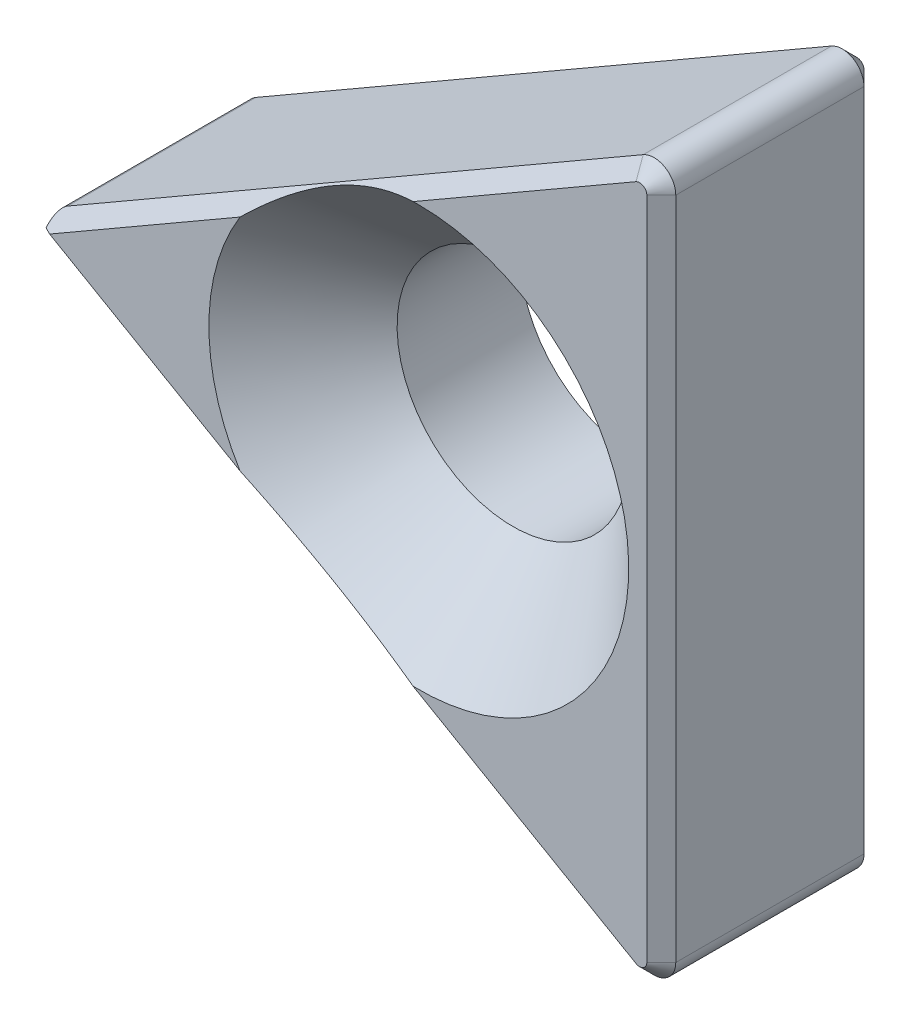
ISO-10303-21;
HEADER;
FILE_DESCRIPTION(('STEP AP214'),'2;1');
FILE_NAME('part.step','',(''),(''),'','','');
FILE_SCHEMA(('AUTOMOTIVE_DESIGN { 1 0 10303 214 1 1 1 1 }'));
ENDSEC;
DATA;
#1=APPLICATION_CONTEXT('core data for automotive mechanical design processes');
#2=APPLICATION_PROTOCOL_DEFINITION('international standard','automotive_design',2000,#1);
#3=PRODUCT_CONTEXT('',#1,'mechanical');
#4=PRODUCT('Part','Part','',(#3));
#5=PRODUCT_RELATED_PRODUCT_CATEGORY('part','',(#4));
#6=PRODUCT_DEFINITION_FORMATION('','',#4);
#7=PRODUCT_DEFINITION_CONTEXT('part definition',#1,'design');
#8=PRODUCT_DEFINITION('design','',#6,#7);
#9=PRODUCT_DEFINITION_SHAPE('','',#8);
#10=(LENGTH_UNIT() NAMED_UNIT(*) SI_UNIT(.MILLI.,.METRE.));
#11=(NAMED_UNIT(*) PLANE_ANGLE_UNIT() SI_UNIT($,.RADIAN.));
#12=(NAMED_UNIT(*) SI_UNIT($,.STERADIAN.) SOLID_ANGLE_UNIT());
#13=UNCERTAINTY_MEASURE_WITH_UNIT(LENGTH_MEASURE(1.E-05),#10,'distance_accuracy_value','');
#14=(GEOMETRIC_REPRESENTATION_CONTEXT(3) GLOBAL_UNCERTAINTY_ASSIGNED_CONTEXT((#13)) GLOBAL_UNIT_ASSIGNED_CONTEXT((#10,
#11,#12)) REPRESENTATION_CONTEXT('',''));
#15=CARTESIAN_POINT('',(0.,0.,0.));
#16=DIRECTION('',(0.,0.,1.));
#17=DIRECTION('',(1.,0.,0.));
#18=AXIS2_PLACEMENT_3D('',#15,#16,#17);
#19=CARTESIAN_POINT('',(3.05,-4.58993464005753,2.8000000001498));
#20=DIRECTION('',(0.,0.,-1.));
#21=DIRECTION('',(0.,-1.,0.));
#22=AXIS2_PLACEMENT_3D('',#19,#20,#21);
#23=CONICAL_SURFACE('',#22,0.299999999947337,0.785398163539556);
#24=DIRECTION('',(0.353553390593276,0.612372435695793,0.707106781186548));
#25=VECTOR('',#24,1.);
#26=CARTESIAN_POINT('',(2.9,-4.84974226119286,2.8));
#27=LINE('',#26,#25);
#28=CARTESIAN_POINT('',(2.9,-4.84974226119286,2.8));
#29=VERTEX_POINT('',#28);
#30=CARTESIAN_POINT('',(2.99999999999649,-4.6765371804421,2.99999999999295));
#31=VERTEX_POINT('',#30);
#32=EDGE_CURVE('E106',#29,#31,#27,.T.);
#33=ORIENTED_EDGE('',*,*,#32,.F.);
#34=CARTESIAN_POINT('',(3.05,-4.58993464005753,2.8));
#35=DIRECTION('',(0.,0.,-1.));
#36=DIRECTION('',(0.,-1.,0.));
#37=AXIS2_PLACEMENT_3D('',#34,#35,#36);
#38=CIRCLE('',#37,0.3);
#39=CARTESIAN_POINT('',(3.35,-4.58993464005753,2.8));
#40=VERTEX_POINT('',#39);
#41=EDGE_CURVE('E301',#40,#29,#38,.T.);
#42=ORIENTED_EDGE('',*,*,#41,.F.);
#43=DIRECTION('',(0.707106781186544,0.,-0.707106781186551));
#44=VECTOR('',#43,1.);
#45=CARTESIAN_POINT('',(3.15,-4.58993464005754,3.));
#46=LINE('',#45,#44);
#47=CARTESIAN_POINT('',(3.15000000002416,-4.58993464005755,2.99999999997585));
#48=VERTEX_POINT('',#47);
#49=EDGE_CURVE('E291',#48,#40,#46,.T.);
#50=ORIENTED_EDGE('',*,*,#49,.F.);
#51=CARTESIAN_POINT('',(3.05,-4.58993464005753,2.9999999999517));
#52=DIRECTION('',(0.,0.,-1.));
#53=DIRECTION('',(0.,-1.,0.));
#54=AXIS2_PLACEMENT_3D('',#51,#52,#53);
#55=CIRCLE('',#54,0.100000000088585);
#56=EDGE_CURVE('E17',#31,#48,#55,.F.);
#57=ORIENTED_EDGE('',*,*,#56,.F.);
#58=EDGE_LOOP('',(#33,#42,#50,#57));
#59=FACE_BOUND('',#58,.T.);
#60=ADVANCED_FACE('F14',(#59),#23,.T.);
#61=CARTESIAN_POINT('',(3.05,4.58993464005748,2.79999999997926));
#62=DIRECTION('',(0.,0.,-1.));
#63=DIRECTION('',(0.,-1.,0.));
#64=AXIS2_PLACEMENT_3D('',#61,#62,#63);
#65=CONICAL_SURFACE('',#64,0.300000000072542,0.785398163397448);
#66=DIRECTION('',(0.707106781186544,0.,-0.707106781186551));
#67=VECTOR('',#66,1.);
#68=CARTESIAN_POINT('',(3.15,4.58993464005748,3.));
#69=LINE('',#68,#67);
#70=CARTESIAN_POINT('',(3.35,4.58993464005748,2.8));
#71=VERTEX_POINT('',#70);
#72=CARTESIAN_POINT('',(3.15000000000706,4.58993464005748,2.99999999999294));
#73=VERTEX_POINT('',#72);
#74=EDGE_CURVE('E294',#71,#73,#69,.F.);
#75=ORIENTED_EDGE('',*,*,#74,.F.);
#76=CARTESIAN_POINT('',(3.05,4.58993464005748,2.8));
#77=DIRECTION('',(0.,0.,-1.));
#78=DIRECTION('',(0.,-1.,0.));
#79=AXIS2_PLACEMENT_3D('',#76,#77,#78);
#80=CIRCLE('',#79,0.3);
#81=CARTESIAN_POINT('',(2.9,4.84974226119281,2.8));
#82=VERTEX_POINT('',#81);
#83=EDGE_CURVE('E288',#82,#71,#80,.T.);
#84=ORIENTED_EDGE('',*,*,#83,.F.);
#85=DIRECTION('',(-0.353553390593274,0.612372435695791,-0.707106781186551));
#86=VECTOR('',#85,1.);
#87=CARTESIAN_POINT('',(3.,4.67653718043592,3.));
#88=LINE('',#87,#86);
#89=CARTESIAN_POINT('',(2.99999999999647,4.67653718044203,2.99999999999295));
#90=VERTEX_POINT('',#89);
#91=EDGE_CURVE('E267',#90,#82,#88,.T.);
#92=ORIENTED_EDGE('',*,*,#91,.F.);
#93=CARTESIAN_POINT('',(3.05,4.58993464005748,2.99999999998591));
#94=DIRECTION('',(0.,0.,-1.));
#95=DIRECTION('',(0.,-1.,0.));
#96=AXIS2_PLACEMENT_3D('',#93,#94,#95);
#97=CIRCLE('',#96,0.100000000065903);
#98=EDGE_CURVE('E279',#73,#90,#97,.F.);
#99=ORIENTED_EDGE('',*,*,#98,.F.);
#100=EDGE_LOOP('',(#75,#84,#92,#99));
#101=FACE_BOUND('',#100,.T.);
#102=ADVANCED_FACE('F149',(#101),#65,.T.);
#103=CARTESIAN_POINT('',(3.05,-4.58993464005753,3.));
#104=DIRECTION('',(0.,0.,-1.));
#105=DIRECTION('',(0.,-1.,0.));
#106=AXIS2_PLACEMENT_3D('',#103,#104,#105);
#107=CYLINDRICAL_SURFACE('',#106,0.3);
#108=CARTESIAN_POINT('',(3.05,-4.58993464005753,0.2));
#109=DIRECTION('',(0.,0.,-1.));
#110=DIRECTION('',(0.,-1.,0.));
#111=AXIS2_PLACEMENT_3D('',#108,#109,#110);
#112=CIRCLE('',#111,0.3);
#113=CARTESIAN_POINT('',(2.8999999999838,-4.84974226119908,0.20000000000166));
#114=VERTEX_POINT('',#113);
#115=CARTESIAN_POINT('',(3.35,-4.58993464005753,0.2));
#116=VERTEX_POINT('',#115);
#117=EDGE_CURVE('E296',#114,#116,#112,.F.);
#118=ORIENTED_EDGE('',*,*,#117,.T.);
#119=DIRECTION('',(0.,0.,1.));
#120=VECTOR('',#119,1.);
#121=CARTESIAN_POINT('',(3.35,-4.58993464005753,3.));
#122=LINE('',#121,#120);
#123=EDGE_CURVE('E252',#116,#40,#122,.T.);
#124=ORIENTED_EDGE('',*,*,#123,.T.);
#125=ORIENTED_EDGE('',*,*,#41,.T.);
#126=DIRECTION('',(0.,0.,1.));
#127=VECTOR('',#126,1.);
#128=CARTESIAN_POINT('',(2.9,-4.84974226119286,3.));
#129=LINE('',#128,#127);
#130=EDGE_CURVE('E256',#29,#114,#129,.F.);
#131=ORIENTED_EDGE('',*,*,#130,.T.);
#132=EDGE_LOOP('',(#118,#124,#125,#131));
#133=FACE_BOUND('',#132,.T.);
#134=ADVANCED_FACE('F146',(#133),#107,.T.);
#135=CARTESIAN_POINT('',(3.15,0.,3.));
#136=DIRECTION('',(0.707106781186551,0.,0.707106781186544));
#137=DIRECTION('',(0.707106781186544,0.,-0.707106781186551));
#138=AXIS2_PLACEMENT_3D('',#135,#136,#137);
#139=PLANE('',#138);
#140=ORIENTED_EDGE('',*,*,#49,.T.);
#141=DIRECTION('',(0.,-1.,0.));
#142=VECTOR('',#141,1.);
#143=CARTESIAN_POINT('',(3.35,-5.10954988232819,2.8));
#144=LINE('',#143,#142);
#145=EDGE_CURVE('E255',#40,#71,#144,.F.);
#146=ORIENTED_EDGE('',*,*,#145,.T.);
#147=ORIENTED_EDGE('',*,*,#74,.T.);
#148=DIRECTION('',(0.,1.,0.));
#149=VECTOR('',#148,1.);
#150=CARTESIAN_POINT('',(3.15,0.,3.));
#151=LINE('',#150,#149);
#152=EDGE_CURVE('E276',#48,#73,#151,.T.);
#153=ORIENTED_EDGE('',*,*,#152,.F.);
#154=EDGE_LOOP('',(#140,#146,#147,#153));
#155=FACE_BOUND('',#154,.T.);
#156=ADVANCED_FACE('F142',(#155),#139,.T.);
#157=CARTESIAN_POINT('',(3.05,4.58993464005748,3.));
#158=DIRECTION('',(0.,0.,-1.));
#159=DIRECTION('',(0.,-1.,0.));
#160=AXIS2_PLACEMENT_3D('',#157,#158,#159);
#161=CYLINDRICAL_SURFACE('',#160,0.3);
#162=DIRECTION('',(0.,0.,1.));
#163=VECTOR('',#162,1.);
#164=CARTESIAN_POINT('',(3.35,4.58993464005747,3.));
#165=LINE('',#164,#163);
#166=CARTESIAN_POINT('',(3.34999999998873,4.58993464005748,0.200000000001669));
#167=VERTEX_POINT('',#166);
#168=EDGE_CURVE('E249',#71,#167,#165,.F.);
#169=ORIENTED_EDGE('',*,*,#168,.T.);
#170=CARTESIAN_POINT('',(3.05,4.58993464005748,0.2));
#171=DIRECTION('',(0.,0.,-1.));
#172=DIRECTION('',(0.,-1.,0.));
#173=AXIS2_PLACEMENT_3D('',#170,#171,#172);
#174=CIRCLE('',#173,0.3);
#175=CARTESIAN_POINT('',(2.9,4.84974226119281,0.2));
#176=VERTEX_POINT('',#175);
#177=EDGE_CURVE('E283',#167,#176,#174,.F.);
#178=ORIENTED_EDGE('',*,*,#177,.T.);
#179=DIRECTION('',(0.,0.,1.));
#180=VECTOR('',#179,1.);
#181=CARTESIAN_POINT('',(2.9,4.84974226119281,3.));
#182=LINE('',#181,#180);
#183=EDGE_CURVE('E246',#176,#82,#182,.T.);
#184=ORIENTED_EDGE('',*,*,#183,.T.);
#185=ORIENTED_EDGE('',*,*,#83,.T.);
#186=EDGE_LOOP('',(#169,#178,#184,#185));
#187=FACE_BOUND('',#186,.T.);
#188=ADVANCED_FACE('F138',(#187),#161,.T.);
#189=CARTESIAN_POINT('',(-4.9,0.,3.));
#190=DIRECTION('',(0.,0.,-1.));
#191=DIRECTION('',(0.,-1.,0.));
#192=AXIS2_PLACEMENT_3D('',#189,#190,#191);
#193=CYLINDRICAL_SURFACE('',#192,0.3);
#194=DIRECTION('',(0.,0.,1.));
#195=VECTOR('',#194,1.);
#196=CARTESIAN_POINT('',(-5.05,0.259807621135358,3.));
#197=LINE('',#196,#195);
#198=CARTESIAN_POINT('',(-5.05,0.259807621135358,2.8));
#199=VERTEX_POINT('',#198);
#200=CARTESIAN_POINT('',(-5.05,0.259807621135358,0.2));
#201=VERTEX_POINT('',#200);
#202=EDGE_CURVE('E97',#199,#201,#197,.F.);
#203=ORIENTED_EDGE('',*,*,#202,.T.);
#204=CARTESIAN_POINT('',(-4.9,0.,0.2));
#205=DIRECTION('',(0.,0.,-1.));
#206=DIRECTION('',(0.,-1.,0.));
#207=AXIS2_PLACEMENT_3D('',#204,#205,#206);
#208=CIRCLE('',#207,0.3);
#209=CARTESIAN_POINT('',(-5.05,-0.259807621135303,0.2));
#210=VERTEX_POINT('',#209);
#211=EDGE_CURVE('E210',#201,#210,#208,.F.);
#212=ORIENTED_EDGE('',*,*,#211,.T.);
#213=DIRECTION('',(0.,0.,1.));
#214=VECTOR('',#213,1.);
#215=CARTESIAN_POINT('',(-5.05,-0.259807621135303,3.));
#216=LINE('',#215,#214);
#217=CARTESIAN_POINT('',(-5.05,-0.259807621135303,2.8));
#218=VERTEX_POINT('',#217);
#219=EDGE_CURVE('E264',#210,#218,#216,.T.);
#220=ORIENTED_EDGE('',*,*,#219,.T.);
#221=CARTESIAN_POINT('',(-4.9,0.,3.1));
#222=DIRECTION('',(-0.353553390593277,-0.612372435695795,0.707106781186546));
#223=DIRECTION('',(-0.353553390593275,-0.612372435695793,-0.707106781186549));
#224=AXIS2_PLACEMENT_3D('',#221,#222,#223);
#225=ELLIPSE('',#224,0.424264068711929,0.3);
#226=CARTESIAN_POINT('',(-5.2,0.,2.95));
#227=VERTEX_POINT('',#226);
#228=EDGE_CURVE('E305',#227,#218,#225,.T.);
#229=ORIENTED_EDGE('',*,*,#228,.F.);
#230=CARTESIAN_POINT('',(-4.9,0.,3.1));
#231=DIRECTION('',(-0.353553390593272,0.612372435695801,0.707106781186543));
#232=DIRECTION('',(-0.353553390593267,0.612372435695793,-0.707106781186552));
#233=AXIS2_PLACEMENT_3D('',#230,#231,#232);
#234=ELLIPSE('',#233,0.424264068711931,0.3);
#235=EDGE_CURVE('E274',#199,#227,#234,.T.);
#236=ORIENTED_EDGE('',*,*,#235,.F.);
#237=EDGE_LOOP('',(#203,#212,#220,#229,#236));
#238=FACE_BOUND('',#237,.T.);
#239=ADVANCED_FACE('F135',(#238),#193,.T.);
#240=CARTESIAN_POINT('',(-5.5,0.,3.));
#241=DIRECTION('',(0.,0.,1.));
#242=DIRECTION('',(0.,1.,0.));
#243=AXIS2_PLACEMENT_3D('',#240,#241,#242);
#244=PLANE('',#243);
#245=ORIENTED_EDGE('',*,*,#98,.T.);
#246=DIRECTION('',(0.866025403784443,0.499999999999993,0.));
#247=VECTOR('',#246,1.);
#248=CARTESIAN_POINT('',(-0.0789126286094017,2.89892614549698,3.));
#249=LINE('',#248,#247);
#250=CARTESIAN_POINT('',(-0.0789126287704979,2.89892614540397,3.));
#251=VERTEX_POINT('',#250);
#252=EDGE_CURVE('E91',#251,#90,#249,.T.);
#253=ORIENTED_EDGE('',*,*,#252,.F.);
#254=CARTESIAN_POINT('',(0.,0.,3.00000000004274));
#255=DIRECTION('',(0.,0.,1.));
#256=DIRECTION('',(0.,1.,0.));
#257=AXIS2_PLACEMENT_3D('',#254,#255,#256);
#258=CIRCLE('',#257,2.89999999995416);
#259=CARTESIAN_POINT('',(-0.0789126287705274,-2.89892614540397,3.));
#260=VERTEX_POINT('',#259);
#261=EDGE_CURVE('E86',#251,#260,#258,.F.);
#262=ORIENTED_EDGE('',*,*,#261,.T.);
#263=DIRECTION('',(-0.866025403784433,0.5,0.));
#264=VECTOR('',#263,1.);
#265=CARTESIAN_POINT('',(3.,-4.67653718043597,3.));
#266=LINE('',#265,#264);
#267=EDGE_CURVE('E89',#31,#260,#266,.T.);
#268=ORIENTED_EDGE('',*,*,#267,.F.);
#269=ORIENTED_EDGE('',*,*,#56,.T.);
#270=ORIENTED_EDGE('',*,*,#152,.T.);
#271=EDGE_LOOP('',(#245,#253,#262,#268,#269,#270));
#272=FACE_BOUND('',#271,.T.);
#273=ADVANCED_FACE('F88',(#272),#244,.T.);
#274=CARTESIAN_POINT('',(-5.4,0.173205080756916,3.));
#275=DIRECTION('',(-0.353553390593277,-0.612372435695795,0.707106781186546));
#276=DIRECTION('',(0.,0.755928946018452,0.654653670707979));
#277=AXIS2_PLACEMENT_3D('',#274,#275,#276);
#278=PLANE('',#277);
#279=DIRECTION('',(0.866025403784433,-0.5,0.));
#280=VECTOR('',#279,1.);
#281=CARTESIAN_POINT('',(-5.1,0.,3.));
#282=LINE('',#281,#280);
#283=CARTESIAN_POINT('',(-5.1,0.,3.));
#284=VERTEX_POINT('',#283);
#285=CARTESIAN_POINT('',(-2.47108737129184,-1.51780341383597,3.00000000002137));
#286=VERTEX_POINT('',#285);
#287=EDGE_CURVE('E107',#284,#286,#282,.T.);
#288=ORIENTED_EDGE('',*,*,#287,.F.);
#289=DIRECTION('',(0.894427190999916,0.,0.447213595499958));
#290=VECTOR('',#289,1.);
#291=CARTESIAN_POINT('',(-5.2,0.,2.95));
#292=LINE('',#291,#290);
#293=EDGE_CURVE('E271',#227,#284,#292,.T.);
#294=ORIENTED_EDGE('',*,*,#293,.F.);
#295=ORIENTED_EDGE('',*,*,#228,.T.);
#296=DIRECTION('',(-0.866025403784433,0.5,0.));
#297=VECTOR('',#296,1.);
#298=CARTESIAN_POINT('',(-5.5,0.,2.8));
#299=LINE('',#298,#297);
#300=EDGE_CURVE('E263',#218,#29,#299,.F.);
#301=ORIENTED_EDGE('',*,*,#300,.T.);
#302=ORIENTED_EDGE('',*,*,#32,.T.);
#303=ORIENTED_EDGE('',*,*,#267,.T.);
#304=CARTESIAN_POINT('',(-0.0789126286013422,-2.89892614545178,3.0000000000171));
#305=CARTESIAN_POINT('',(-0.192122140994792,-2.86696599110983,2.9710735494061));
#306=CARTESIAN_POINT('',(-0.305193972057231,-2.83137857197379,2.94535724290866));
#307=CARTESIAN_POINT('',(-0.530230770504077,-2.752758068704,2.90092619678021));
#308=CARTESIAN_POINT('',(-0.642194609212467,-2.70971808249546,2.88221799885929));
#309=CARTESIAN_POINT('',(-0.860537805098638,-2.61750952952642,2.85290135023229));
#310=CARTESIAN_POINT('',(-0.966982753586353,-2.56857185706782,2.84206014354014));
#311=CARTESIAN_POINT('',(-1.17685413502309,-2.46375999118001,2.827894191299));
#312=CARTESIAN_POINT('',(-1.28028213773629,-2.40788948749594,2.82456546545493));
#313=CARTESIAN_POINT('',(-1.48016581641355,-2.29139481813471,2.82551096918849));
#314=CARTESIAN_POINT('',(-1.57673799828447,-2.23096841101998,2.82955568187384));
#315=CARTESIAN_POINT('',(-1.76559564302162,-2.10447058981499,2.84467718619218));
#316=CARTESIAN_POINT('',(-1.85787910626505,-2.03839658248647,2.8557572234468));
#317=CARTESIAN_POINT('',(-2.04036040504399,-1.89918722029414,2.88507541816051));
#318=CARTESIAN_POINT('',(-2.1304051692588,-1.8258965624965,2.90352460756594));
#319=CARTESIAN_POINT('',(-2.30495118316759,-1.67494016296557,2.94698367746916));
#320=CARTESIAN_POINT('',(-2.38945716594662,-1.59727826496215,2.97198786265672));
#321=CARTESIAN_POINT('',(-2.4710873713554,-1.51780341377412,3.00000000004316));
#322=B_SPLINE_CURVE_WITH_KNOTS('',3,(#304,#305,#306,#307,#308,#309,#310,#311,#312,#313,#314,
#315,#316,#317,#318,#319,#320,#321),.UNSPECIFIED.,.F.,.F.,(4,2,2,2,2,2,2,2,4),(0.,
0.363414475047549,0.727167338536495,1.079662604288,1.43197106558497,1.77349968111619,
2.11518596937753,2.46745281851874,2.81941460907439),.UNSPECIFIED.);
#323=EDGE_CURVE('E96',#260,#286,#322,.T.);
#324=ORIENTED_EDGE('',*,*,#323,.T.);
#325=EDGE_LOOP('',(#288,#294,#295,#301,#302,#303,#324));
#326=FACE_BOUND('',#325,.T.);
#327=ADVANCED_FACE('F103',(#326),#278,.T.);
#328=CARTESIAN_POINT('',(-5.5,0.,3.));
#329=DIRECTION('',(0.,0.,1.));
#330=DIRECTION('',(0.,1.,0.));
#331=AXIS2_PLACEMENT_3D('',#328,#329,#330);
#332=PLANE('',#331);
#333=ORIENTED_EDGE('',*,*,#287,.T.);
#334=CARTESIAN_POINT('',(0.,0.,3.00000000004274));
#335=DIRECTION('',(0.,0.,1.));
#336=DIRECTION('',(0.,1.,0.));
#337=AXIS2_PLACEMENT_3D('',#334,#335,#336);
#338=CIRCLE('',#337,2.89999999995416);
#339=CARTESIAN_POINT('',(-2.4710873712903,1.51780341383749,3.00000000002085));
#340=VERTEX_POINT('',#339);
#341=EDGE_CURVE('E112',#286,#340,#338,.F.);
#342=ORIENTED_EDGE('',*,*,#341,.T.);
#343=DIRECTION('',(0.866025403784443,0.499999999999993,0.));
#344=VECTOR('',#343,1.);
#345=CARTESIAN_POINT('',(-5.1,0.,3.));
#346=LINE('',#345,#344);
#347=EDGE_CURVE('E269',#284,#340,#346,.T.);
#348=ORIENTED_EDGE('',*,*,#347,.F.);
#349=EDGE_LOOP('',(#333,#342,#348));
#350=FACE_BOUND('',#349,.T.);
#351=ADVANCED_FACE('F131',(#350),#332,.T.);
#352=CARTESIAN_POINT('',(-5.4,-0.173205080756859,3.));
#353=DIRECTION('',(-0.353553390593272,0.612372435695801,0.707106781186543));
#354=DIRECTION('',(0.,0.75592894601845,-0.654653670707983));
#355=AXIS2_PLACEMENT_3D('',#352,#353,#354);
#356=PLANE('',#355);
#357=ORIENTED_EDGE('',*,*,#252,.T.);
#358=ORIENTED_EDGE('',*,*,#91,.T.);
#359=DIRECTION('',(0.866025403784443,0.499999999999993,0.));
#360=VECTOR('',#359,1.);
#361=CARTESIAN_POINT('',(3.35,5.10954988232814,2.8));
#362=LINE('',#361,#360);
#363=EDGE_CURVE('E245',#82,#199,#362,.F.);
#364=ORIENTED_EDGE('',*,*,#363,.T.);
#365=ORIENTED_EDGE('',*,*,#235,.T.);
#366=ORIENTED_EDGE('',*,*,#293,.T.);
#367=ORIENTED_EDGE('',*,*,#347,.T.);
#368=CARTESIAN_POINT('',(-2.47108737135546,1.51780341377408,3.0000000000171));
#369=CARTESIAN_POINT('',(-2.38680430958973,1.59986565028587,2.9710735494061));
#370=CARTESIAN_POINT('',(-2.29944878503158,1.67999501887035,2.94535724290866));
#371=CARTESIAN_POINT('',(-2.1188430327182,1.83557235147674,2.90092619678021));
#372=CARTESIAN_POINT('',(-2.02558739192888,1.91101588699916,2.88221799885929));
#373=CARTESIAN_POINT('',(-1.8365608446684,2.05400236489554,2.85290135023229));
#374=CARTESIAN_POINT('',(-1.74095710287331,2.12171755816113,2.84206014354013));
#375=CARTESIAN_POINT('',(-1.54525167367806,2.25106557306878,2.827894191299));
#376=CARTESIAN_POINT('',(-1.44515239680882,2.31270159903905,2.82456546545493));
#377=CARTESIAN_POINT('',(-1.24432321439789,2.42755860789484,2.8255109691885));
#378=CARTESIAN_POINT('',(-1.14370631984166,2.48097936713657,2.82955568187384));
#379=CARTESIAN_POINT('',(-0.939727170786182,2.58128597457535,2.84467718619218));
#380=CARTESIAN_POINT('',(-0.836363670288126,2.6281687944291,2.8557572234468));
#381=CARTESIAN_POINT('',(-0.624564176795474,2.71659755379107,2.88507541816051));
#382=CARTESIAN_POINT('',(-0.516070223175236,2.75793327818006,2.90352460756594));
#383=CARTESIAN_POINT('',(-0.298065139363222,2.83361636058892,2.94698367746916));
#384=CARTESIAN_POINT('',(-0.188554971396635,2.86796973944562,2.97198786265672));
#385=CARTESIAN_POINT('',(-0.0789126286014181,2.89892614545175,3.00000000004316));
#386=B_SPLINE_CURVE_WITH_KNOTS('',3,(#368,#369,#370,#371,#372,#373,#374,#375,#376,#377,#378,
#379,#380,#381,#382,#383,#384,#385),.UNSPECIFIED.,.F.,.F.,(4,2,2,2,2,2,2,2,4),(0.,
0.363414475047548,0.727167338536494,1.079662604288,1.43197106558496,1.77349968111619,
2.11518596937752,2.46745281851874,2.81941460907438),.UNSPECIFIED.);
#387=EDGE_CURVE('E114',#340,#251,#386,.T.);
#388=ORIENTED_EDGE('',*,*,#387,.T.);
#389=EDGE_LOOP('',(#357,#358,#364,#365,#366,#367,#388));
#390=FACE_BOUND('',#389,.T.);
#391=ADVANCED_FACE('F313',(#390),#356,.T.);
#392=CARTESIAN_POINT('',(-5.5,0.,3.));
#393=DIRECTION('',(0.5,0.866025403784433,0.));
#394=DIRECTION('',(-0.866025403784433,0.5,0.));
#395=AXIS2_PLACEMENT_3D('',#392,#393,#394);
#396=PLANE('',#395);
#397=ORIENTED_EDGE('',*,*,#300,.F.);
#398=ORIENTED_EDGE('',*,*,#219,.F.);
#399=DIRECTION('',(0.866025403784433,-0.5,0.));
#400=VECTOR('',#399,1.);
#401=CARTESIAN_POINT('',(-5.05,-0.259807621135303,0.2));
#402=LINE('',#401,#400);
#403=EDGE_CURVE('E238',#210,#114,#402,.T.);
#404=ORIENTED_EDGE('',*,*,#403,.T.);
#405=ORIENTED_EDGE('',*,*,#130,.F.);
#406=EDGE_LOOP('',(#397,#398,#404,#405));
#407=FACE_BOUND('',#406,.T.);
#408=ADVANCED_FACE('F317',(#407),#396,.F.);
#409=CARTESIAN_POINT('',(3.35,-5.10954988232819,3.));
#410=DIRECTION('',(-1.,0.,0.));
#411=DIRECTION('',(0.,-1.,0.));
#412=AXIS2_PLACEMENT_3D('',#409,#410,#411);
#413=PLANE('',#412);
#414=ORIENTED_EDGE('',*,*,#145,.F.);
#415=ORIENTED_EDGE('',*,*,#123,.F.);
#416=DIRECTION('',(0.,1.,0.));
#417=VECTOR('',#416,1.);
#418=CARTESIAN_POINT('',(3.35,-5.10954988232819,0.2));
#419=LINE('',#418,#417);
#420=EDGE_CURVE('E235',#116,#167,#419,.T.);
#421=ORIENTED_EDGE('',*,*,#420,.T.);
#422=ORIENTED_EDGE('',*,*,#168,.F.);
#423=EDGE_LOOP('',(#414,#415,#421,#422));
#424=FACE_BOUND('',#423,.T.);
#425=ADVANCED_FACE('F321',(#424),#413,.F.);
#426=CARTESIAN_POINT('',(3.35,5.10954988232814,3.));
#427=DIRECTION('',(0.499999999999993,-0.866025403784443,0.));
#428=DIRECTION('',(0.866025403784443,0.499999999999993,0.));
#429=AXIS2_PLACEMENT_3D('',#426,#427,#428);
#430=PLANE('',#429);
#431=ORIENTED_EDGE('',*,*,#363,.F.);
#432=ORIENTED_EDGE('',*,*,#183,.F.);
#433=DIRECTION('',(-0.866025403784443,-0.499999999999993,0.));
#434=VECTOR('',#433,1.);
#435=CARTESIAN_POINT('',(2.9,4.84974226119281,0.2));
#436=LINE('',#435,#434);
#437=EDGE_CURVE('E215',#176,#201,#436,.T.);
#438=ORIENTED_EDGE('',*,*,#437,.T.);
#439=ORIENTED_EDGE('',*,*,#202,.F.);
#440=EDGE_LOOP('',(#431,#432,#438,#439));
#441=FACE_BOUND('',#440,.T.);
#442=ADVANCED_FACE('F199',(#441),#430,.F.);
#443=CARTESIAN_POINT('',(0.,0.,2.99999999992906));
#444=DIRECTION('',(0.,0.,1.));
#445=DIRECTION('',(0.,1.,0.));
#446=AXIS2_PLACEMENT_3D('',#443,#444,#445);
#447=CONICAL_SURFACE('',#446,2.89999999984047,0.785398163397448);
#448=CARTESIAN_POINT('',(0.,0.,1.7));
#449=DIRECTION('',(0.,0.,1.));
#450=DIRECTION('',(0.,1.,0.));
#451=AXIS2_PLACEMENT_3D('',#448,#449,#450);
#452=CIRCLE('',#451,1.6);
#453=CARTESIAN_POINT('',(0.,1.6,1.7));
#454=VERTEX_POINT('',#453);
#455=EDGE_CURVE('E214',#454,#454,#452,.F.);
#456=ORIENTED_EDGE('',*,*,#455,.T.);
#457=EDGE_LOOP('',(#456));
#458=FACE_BOUND('',#457,.T.);
#459=ORIENTED_EDGE('',*,*,#261,.F.);
#460=ORIENTED_EDGE('',*,*,#387,.F.);
#461=ORIENTED_EDGE('',*,*,#341,.F.);
#462=ORIENTED_EDGE('',*,*,#323,.F.);
#463=EDGE_LOOP('',(#459,#460,#461,#462));
#464=FACE_BOUND('',#463,.T.);
#465=ADVANCED_FACE('F110',(#458,#464),#447,.F.);
#466=CARTESIAN_POINT('',(-4.9,0.,0.199999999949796));
#467=DIRECTION('',(0.,0.,1.));
#468=DIRECTION('',(1.,0.,0.));
#469=AXIS2_PLACEMENT_3D('',#466,#467,#468);
#470=CONICAL_SURFACE('',#469,0.299999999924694,0.785398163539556);
#471=DIRECTION('',(0.353553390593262,-0.6123724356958,-0.707106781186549));
#472=VECTOR('',#471,1.);
#473=CARTESIAN_POINT('',(-5.05,0.259807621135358,0.2));
#474=LINE('',#473,#472);
#475=CARTESIAN_POINT('',(-4.95000000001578,0.0866025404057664,3.1518089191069E-11));
#476=VERTEX_POINT('',#475);
#477=EDGE_CURVE('E205',#201,#476,#474,.T.);
#478=ORIENTED_EDGE('',*,*,#477,.T.);
#479=CARTESIAN_POINT('',(-4.9,0.,6.30361648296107E-11));
#480=DIRECTION('',(0.,0.,1.));
#481=DIRECTION('',(1.,0.,0.));
#482=AXIS2_PLACEMENT_3D('',#479,#480,#481);
#483=CIRCLE('',#482,0.099999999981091);
#484=CARTESIAN_POINT('',(-4.95000000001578,-0.0866025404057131,3.15180526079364E-11));
#485=VERTEX_POINT('',#484);
#486=EDGE_CURVE('E208',#476,#485,#483,.T.);
#487=ORIENTED_EDGE('',*,*,#486,.T.);
#488=DIRECTION('',(-0.353553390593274,-0.612372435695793,0.707106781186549));
#489=VECTOR('',#488,1.);
#490=CARTESIAN_POINT('',(-4.95,-0.0866025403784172,0.));
#491=LINE('',#490,#489);
#492=EDGE_CURVE('E239',#485,#210,#491,.T.);
#493=ORIENTED_EDGE('',*,*,#492,.T.);
#494=ORIENTED_EDGE('',*,*,#211,.F.);
#495=EDGE_LOOP('',(#478,#487,#493,#494));
#496=FACE_BOUND('',#495,.T.);
#497=ADVANCED_FACE('F191',(#496),#470,.T.);
#498=CARTESIAN_POINT('',(-5.5,0.,0.2));
#499=DIRECTION('',(0.353553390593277,0.612372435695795,0.707106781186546));
#500=DIRECTION('',(0.,0.755928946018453,-0.654653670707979));
#501=AXIS2_PLACEMENT_3D('',#498,#499,#500);
#502=PLANE('',#501);
#503=ORIENTED_EDGE('',*,*,#403,.F.);
#504=ORIENTED_EDGE('',*,*,#492,.F.);
#505=DIRECTION('',(0.866025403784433,-0.5,0.));
#506=VECTOR('',#505,1.);
#507=CARTESIAN_POINT('',(-4.95,-0.0866025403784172,0.));
#508=LINE('',#507,#506);
#509=CARTESIAN_POINT('',(3.00000000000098,-4.67653718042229,-3.53202303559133E-11));
#510=VERTEX_POINT('',#509);
#511=EDGE_CURVE('E226',#485,#510,#508,.T.);
#512=ORIENTED_EDGE('',*,*,#511,.T.);
#513=DIRECTION('',(0.353553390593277,0.612372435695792,-0.707106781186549));
#514=VECTOR('',#513,1.);
#515=CARTESIAN_POINT('',(-249497.,-432151.353025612,499000.));
#516=LINE('',#515,#514);
#517=EDGE_CURVE('E236',#114,#510,#516,.T.);
#518=ORIENTED_EDGE('',*,*,#517,.F.);
#519=EDGE_LOOP('',(#503,#504,#512,#518));
#520=FACE_BOUND('',#519,.T.);
#521=ADVANCED_FACE('F188',(#520),#502,.F.);
#522=CARTESIAN_POINT('',(3.05,-4.58993464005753,0.20000000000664));
#523=DIRECTION('',(0.,0.,1.));
#524=DIRECTION('',(0.,1.,0.));
#525=AXIS2_PLACEMENT_3D('',#522,#523,#524);
#526=CONICAL_SURFACE('',#525,0.300000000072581,0.785398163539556);
#527=ORIENTED_EDGE('',*,*,#117,.F.);
#528=ORIENTED_EDGE('',*,*,#517,.T.);
#529=CARTESIAN_POINT('',(3.05,-4.58993464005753,-1.37970418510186E-11));
#530=DIRECTION('',(0.,0.,1.));
#531=DIRECTION('',(0.,1.,0.));
#532=AXIS2_PLACEMENT_3D('',#529,#530,#531);
#533=CIRCLE('',#532,0.0999999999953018);
#534=CARTESIAN_POINT('',(3.14999999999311,-4.58993464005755,-6.89860901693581E-12));
#535=VERTEX_POINT('',#534);
#536=EDGE_CURVE('E225',#510,#535,#533,.T.);
#537=ORIENTED_EDGE('',*,*,#536,.T.);
#538=DIRECTION('',(0.707106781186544,0.,0.707106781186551));
#539=VECTOR('',#538,1.);
#540=CARTESIAN_POINT('',(3.35,-4.58993464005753,0.200000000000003));
#541=LINE('',#540,#539);
#542=EDGE_CURVE('E232',#535,#116,#541,.T.);
#543=ORIENTED_EDGE('',*,*,#542,.T.);
#544=EDGE_LOOP('',(#527,#528,#537,#543));
#545=FACE_BOUND('',#544,.T.);
#546=ADVANCED_FACE('F184',(#545),#526,.T.);
#547=CARTESIAN_POINT('',(3.35,-5.10954988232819,0.2));
#548=DIRECTION('',(-0.707106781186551,0.,0.707106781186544));
#549=DIRECTION('',(0.707106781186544,0.,0.707106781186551));
#550=AXIS2_PLACEMENT_3D('',#547,#548,#549);
#551=PLANE('',#550);
#552=DIRECTION('',(0.,1.,0.));
#553=VECTOR('',#552,1.);
#554=CARTESIAN_POINT('',(3.15,0.,0.));
#555=LINE('',#554,#553);
#556=CARTESIAN_POINT('',(3.15000000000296,4.58993464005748,1.4210854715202E-11));
#557=VERTEX_POINT('',#556);
#558=EDGE_CURVE('E220',#535,#557,#555,.T.);
#559=ORIENTED_EDGE('',*,*,#558,.T.);
#560=DIRECTION('',(-0.707106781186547,0.,-0.707106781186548));
#561=VECTOR('',#560,1.);
#562=CARTESIAN_POINT('',(498998.46006536,4.58993463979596,498995.310065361));
#563=LINE('',#562,#561);
#564=EDGE_CURVE('E229',#167,#557,#563,.T.);
#565=ORIENTED_EDGE('',*,*,#564,.F.);
#566=ORIENTED_EDGE('',*,*,#420,.F.);
#567=ORIENTED_EDGE('',*,*,#542,.F.);
#568=EDGE_LOOP('',(#559,#565,#566,#567));
#569=FACE_BOUND('',#568,.T.);
#570=ADVANCED_FACE('F181',(#569),#551,.F.);
#571=CARTESIAN_POINT('',(3.05,4.58993464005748,0.20000000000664));
#572=DIRECTION('',(0.,0.,1.));
#573=DIRECTION('',(0.,1.,0.));
#574=AXIS2_PLACEMENT_3D('',#571,#572,#573);
#575=CONICAL_SURFACE('',#574,0.299999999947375,0.78539816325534);
#576=DIRECTION('',(-0.353553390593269,0.612372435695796,0.707106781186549));
#577=VECTOR('',#576,1.);
#578=CARTESIAN_POINT('',(3.,4.67653718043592,0.));
#579=LINE('',#578,#577);
#580=CARTESIAN_POINT('',(2.99999999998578,4.67653718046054,2.84216518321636E-11));
#581=VERTEX_POINT('',#580);
#582=EDGE_CURVE('E218',#581,#176,#579,.T.);
#583=ORIENTED_EDGE('',*,*,#582,.T.);
#584=ORIENTED_EDGE('',*,*,#177,.F.);
#585=ORIENTED_EDGE('',*,*,#564,.T.);
#586=CARTESIAN_POINT('',(3.05,4.58993464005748,5.6843418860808E-11));
#587=DIRECTION('',(0.,0.,1.));
#588=DIRECTION('',(0.,1.,0.));
#589=AXIS2_PLACEMENT_3D('',#586,#587,#588);
#590=CIRCLE('',#589,0.100000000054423);
#591=EDGE_CURVE('E32',#557,#581,#590,.T.);
#592=ORIENTED_EDGE('',*,*,#591,.T.);
#593=EDGE_LOOP('',(#583,#584,#585,#592));
#594=FACE_BOUND('',#593,.T.);
#595=ADVANCED_FACE('F177',(#594),#575,.T.);
#596=CARTESIAN_POINT('',(3.35,5.10954988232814,0.2));
#597=DIRECTION('',(0.35355339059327,-0.612372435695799,0.707106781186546));
#598=DIRECTION('',(0.,0.755928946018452,0.654653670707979));
#599=AXIS2_PLACEMENT_3D('',#596,#597,#598);
#600=PLANE('',#599);
#601=ORIENTED_EDGE('',*,*,#437,.F.);
#602=ORIENTED_EDGE('',*,*,#582,.F.);
#603=DIRECTION('',(-0.866025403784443,-0.499999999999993,0.));
#604=VECTOR('',#603,1.);
#605=CARTESIAN_POINT('',(3.,4.67653718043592,0.));
#606=LINE('',#605,#604);
#607=EDGE_CURVE('E23',#581,#476,#606,.T.);
#608=ORIENTED_EDGE('',*,*,#607,.T.);
#609=ORIENTED_EDGE('',*,*,#477,.F.);
#610=EDGE_LOOP('',(#601,#602,#608,#609));
#611=FACE_BOUND('',#610,.T.);
#612=ADVANCED_FACE('F169',(#611),#600,.F.);
#613=CARTESIAN_POINT('',(0.,0.,0.));
#614=DIRECTION('',(0.,0.,1.));
#615=DIRECTION('',(0.,1.,0.));
#616=AXIS2_PLACEMENT_3D('',#613,#614,#615);
#617=CYLINDRICAL_SURFACE('',#616,1.6);
#618=CARTESIAN_POINT('',(0.,0.,0.));
#619=DIRECTION('',(0.,0.,1.));
#620=DIRECTION('',(0.,1.,0.));
#621=AXIS2_PLACEMENT_3D('',#618,#619,#620);
#622=CIRCLE('',#621,1.6);
#623=CARTESIAN_POINT('',(0.,1.6,0.));
#624=VERTEX_POINT('',#623);
#625=EDGE_CURVE('E9',#624,#624,#622,.F.);
#626=ORIENTED_EDGE('',*,*,#625,.T.);
#627=EDGE_LOOP('',(#626));
#628=FACE_BOUND('',#627,.T.);
#629=ORIENTED_EDGE('',*,*,#455,.F.);
#630=EDGE_LOOP('',(#629));
#631=FACE_BOUND('',#630,.T.);
#632=ADVANCED_FACE('F162',(#628,#631),#617,.F.);
#633=CARTESIAN_POINT('',(-5.5,0.,0.));
#634=DIRECTION('',(0.,0.,1.));
#635=DIRECTION('',(0.,1.,0.));
#636=AXIS2_PLACEMENT_3D('',#633,#634,#635);
#637=PLANE('',#636);
#638=ORIENTED_EDGE('',*,*,#625,.F.);
#639=EDGE_LOOP('',(#638));
#640=FACE_BOUND('',#639,.T.);
#641=ORIENTED_EDGE('',*,*,#607,.F.);
#642=ORIENTED_EDGE('',*,*,#591,.F.);
#643=ORIENTED_EDGE('',*,*,#558,.F.);
#644=ORIENTED_EDGE('',*,*,#536,.F.);
#645=ORIENTED_EDGE('',*,*,#511,.F.);
#646=ORIENTED_EDGE('',*,*,#486,.F.);
#647=EDGE_LOOP('',(#641,#642,#643,#644,#645,#646));
#648=FACE_BOUND('',#647,.T.);
#649=ADVANCED_FACE('F160',(#640,#648),#637,.F.);
#650=CLOSED_SHELL('',(#60,#102,#134,#156,#188,#239,#273,#327,#351,#391,#408,#425,#442,#465,#497,
#521,#546,#570,#595,#612,#632,#649));
#651=MANIFOLD_SOLID_BREP('B1',#650);
#652=ADVANCED_BREP_SHAPE_REPRESENTATION('',(#18,#651),#14);
#653=SHAPE_DEFINITION_REPRESENTATION(#9,#652);
ENDSEC;
END-ISO-10303-21;
